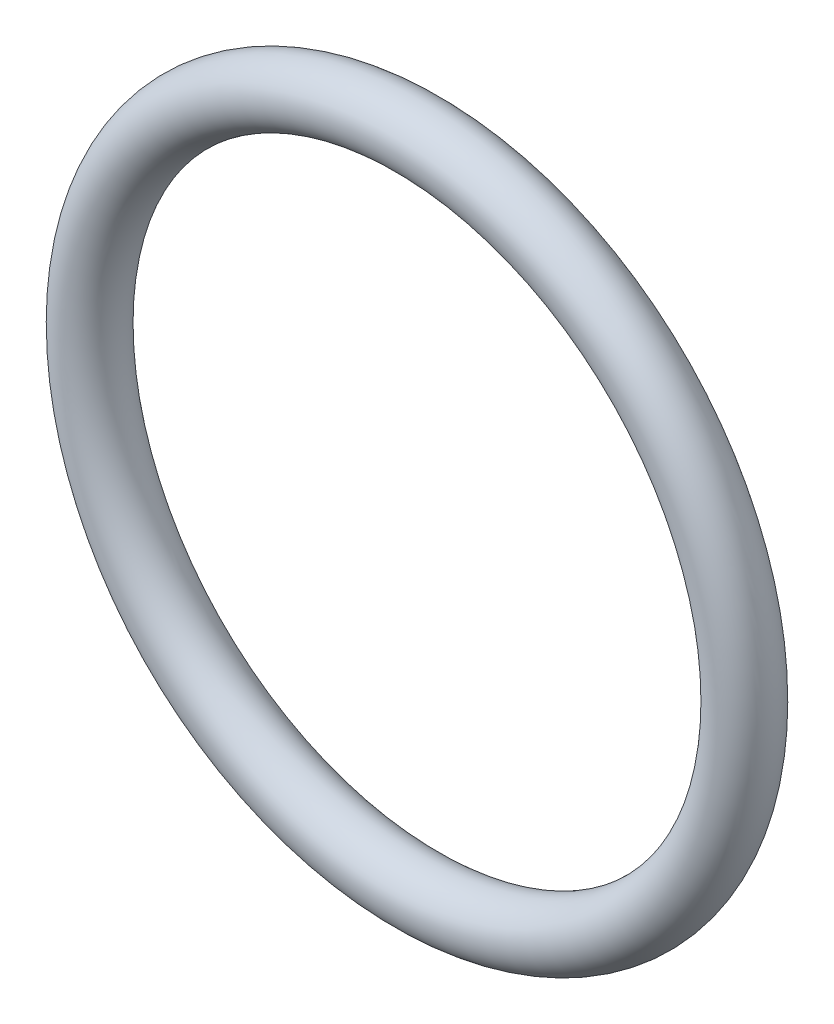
from build123d import *

# Parameters (mm, degrees)
SKETCH1_R = 0.889


with BuildPart() as part:
    # Sketch1 → Revolve1 (revolve)
    with BuildSketch(Plane(origin=(0, 0, 0), x_dir=(0, -1, 0), z_dir=(1, 0, 0)), mode=Mode.PRIVATE) as revolve1_sk:
        with Locations((9.4742, 0)):
            Circle(SKETCH1_R)
    revolve(revolve1_sk.sketch.rotate(Axis((0, 0, 0.889), (0, 0, -1)), 270), axis=Axis((0, 0, 0.889), (0, 0, -1)))


solid = part.part
